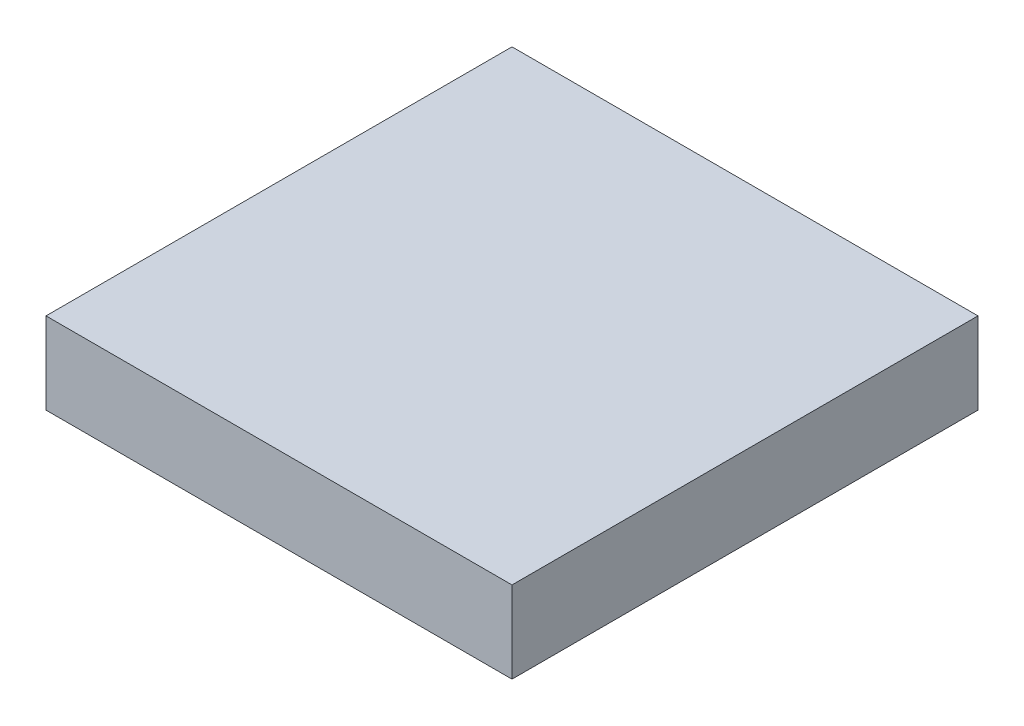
ISO-10303-21;
HEADER;
FILE_DESCRIPTION(('STEP AP214'),'2;1');
FILE_NAME('part.step','',(''),(''),'','','');
FILE_SCHEMA(('AUTOMOTIVE_DESIGN { 1 0 10303 214 1 1 1 1 }'));
ENDSEC;
DATA;
#1=APPLICATION_CONTEXT('core data for automotive mechanical design processes');
#2=APPLICATION_PROTOCOL_DEFINITION('international standard','automotive_design',2000,#1);
#3=PRODUCT_CONTEXT('',#1,'mechanical');
#4=PRODUCT('Part','Part','',(#3));
#5=PRODUCT_RELATED_PRODUCT_CATEGORY('part','',(#4));
#6=PRODUCT_DEFINITION_FORMATION('','',#4);
#7=PRODUCT_DEFINITION_CONTEXT('part definition',#1,'design');
#8=PRODUCT_DEFINITION('design','',#6,#7);
#9=PRODUCT_DEFINITION_SHAPE('','',#8);
#10=(LENGTH_UNIT() NAMED_UNIT(*) SI_UNIT(.MILLI.,.METRE.));
#11=(NAMED_UNIT(*) PLANE_ANGLE_UNIT() SI_UNIT($,.RADIAN.));
#12=(NAMED_UNIT(*) SI_UNIT($,.STERADIAN.) SOLID_ANGLE_UNIT());
#13=UNCERTAINTY_MEASURE_WITH_UNIT(LENGTH_MEASURE(1.E-05),#10,'distance_accuracy_value','');
#14=(GEOMETRIC_REPRESENTATION_CONTEXT(3) GLOBAL_UNCERTAINTY_ASSIGNED_CONTEXT((#13)) GLOBAL_UNIT_ASSIGNED_CONTEXT((#10,
#11,#12)) REPRESENTATION_CONTEXT('',''));
#15=CARTESIAN_POINT('',(0.,0.,0.));
#16=DIRECTION('',(0.,0.,1.));
#17=DIRECTION('',(1.,0.,0.));
#18=AXIS2_PLACEMENT_3D('',#15,#16,#17);
#19=CARTESIAN_POINT('',(145.,50.8,145.));
#20=DIRECTION('',(-1.,0.,0.));
#21=DIRECTION('',(0.,0.,1.));
#22=AXIS2_PLACEMENT_3D('',#19,#20,#21);
#23=PLANE('',#22);
#24=DIRECTION('',(0.,0.,-1.));
#25=VECTOR('',#24,1.);
#26=CARTESIAN_POINT('',(145.,0.,145.));
#27=LINE('',#26,#25);
#28=CARTESIAN_POINT('',(145.,0.,145.));
#29=VERTEX_POINT('',#28);
#30=CARTESIAN_POINT('',(145.,0.,-145.));
#31=VERTEX_POINT('',#30);
#32=EDGE_CURVE('E114',#29,#31,#27,.T.);
#33=ORIENTED_EDGE('',*,*,#32,.T.);
#34=DIRECTION('',(0.,-1.,0.));
#35=VECTOR('',#34,1.);
#36=CARTESIAN_POINT('',(145.,50.8,-145.));
#37=LINE('',#36,#35);
#38=CARTESIAN_POINT('',(145.,50.8,-145.));
#39=VERTEX_POINT('',#38);
#40=EDGE_CURVE('E11',#39,#31,#37,.T.);
#41=ORIENTED_EDGE('',*,*,#40,.F.);
#42=DIRECTION('',(0.,0.,-1.));
#43=VECTOR('',#42,1.);
#44=CARTESIAN_POINT('',(145.,50.8,145.));
#45=LINE('',#44,#43);
#46=CARTESIAN_POINT('',(145.,50.8,145.));
#47=VERTEX_POINT('',#46);
#48=EDGE_CURVE('E100',#47,#39,#45,.T.);
#49=ORIENTED_EDGE('',*,*,#48,.F.);
#50=DIRECTION('',(0.,-1.,0.));
#51=VECTOR('',#50,1.);
#52=CARTESIAN_POINT('',(145.,50.8,145.));
#53=LINE('',#52,#51);
#54=EDGE_CURVE('E108',#47,#29,#53,.T.);
#55=ORIENTED_EDGE('',*,*,#54,.T.);
#56=EDGE_LOOP('',(#33,#41,#49,#55));
#57=FACE_BOUND('',#56,.T.);
#58=ADVANCED_FACE('F44',(#57),#23,.F.);
#59=CARTESIAN_POINT('',(145.,50.8,-145.));
#60=DIRECTION('',(0.,0.,1.));
#61=DIRECTION('',(1.,0.,0.));
#62=AXIS2_PLACEMENT_3D('',#59,#60,#61);
#63=PLANE('',#62);
#64=DIRECTION('',(-1.,0.,0.));
#65=VECTOR('',#64,1.);
#66=CARTESIAN_POINT('',(145.,0.,-145.));
#67=LINE('',#66,#65);
#68=CARTESIAN_POINT('',(-145.,0.,-145.));
#69=VERTEX_POINT('',#68);
#70=EDGE_CURVE('E105',#31,#69,#67,.T.);
#71=ORIENTED_EDGE('',*,*,#70,.T.);
#72=DIRECTION('',(0.,-1.,0.));
#73=VECTOR('',#72,1.);
#74=CARTESIAN_POINT('',(-145.,50.8,-145.));
#75=LINE('',#74,#73);
#76=CARTESIAN_POINT('',(-145.,50.8,-145.));
#77=VERTEX_POINT('',#76);
#78=EDGE_CURVE('E53',#77,#69,#75,.T.);
#79=ORIENTED_EDGE('',*,*,#78,.F.);
#80=DIRECTION('',(-1.,0.,0.));
#81=VECTOR('',#80,1.);
#82=CARTESIAN_POINT('',(145.,50.8,-145.));
#83=LINE('',#82,#81);
#84=EDGE_CURVE('E95',#39,#77,#83,.T.);
#85=ORIENTED_EDGE('',*,*,#84,.F.);
#86=ORIENTED_EDGE('',*,*,#40,.T.);
#87=EDGE_LOOP('',(#71,#79,#85,#86));
#88=FACE_BOUND('',#87,.T.);
#89=ADVANCED_FACE('F101',(#88),#63,.F.);
#90=CARTESIAN_POINT('',(-145.,50.8,145.));
#91=DIRECTION('',(1.,0.,0.));
#92=DIRECTION('',(0.,0.,-1.));
#93=AXIS2_PLACEMENT_3D('',#90,#91,#92);
#94=PLANE('',#93);
#95=DIRECTION('',(0.,0.,1.));
#96=VECTOR('',#95,1.);
#97=CARTESIAN_POINT('',(-145.,0.,145.));
#98=LINE('',#97,#96);
#99=CARTESIAN_POINT('',(-145.,0.,145.));
#100=VERTEX_POINT('',#99);
#101=EDGE_CURVE('E77',#69,#100,#98,.T.);
#102=ORIENTED_EDGE('',*,*,#101,.T.);
#103=DIRECTION('',(0.,-1.,0.));
#104=VECTOR('',#103,1.);
#105=CARTESIAN_POINT('',(-145.,50.8,145.));
#106=LINE('',#105,#104);
#107=CARTESIAN_POINT('',(-145.,50.8,145.));
#108=VERTEX_POINT('',#107);
#109=EDGE_CURVE('E102',#108,#100,#106,.T.);
#110=ORIENTED_EDGE('',*,*,#109,.F.);
#111=DIRECTION('',(0.,0.,1.));
#112=VECTOR('',#111,1.);
#113=CARTESIAN_POINT('',(-145.,50.8,145.));
#114=LINE('',#113,#112);
#115=EDGE_CURVE('E92',#77,#108,#114,.T.);
#116=ORIENTED_EDGE('',*,*,#115,.F.);
#117=ORIENTED_EDGE('',*,*,#78,.T.);
#118=EDGE_LOOP('',(#102,#110,#116,#117));
#119=FACE_BOUND('',#118,.T.);
#120=ADVANCED_FACE('F104',(#119),#94,.F.);
#121=CARTESIAN_POINT('',(145.,50.8,145.));
#122=DIRECTION('',(0.,0.,-1.));
#123=DIRECTION('',(-1.,0.,0.));
#124=AXIS2_PLACEMENT_3D('',#121,#122,#123);
#125=PLANE('',#124);
#126=DIRECTION('',(1.,0.,0.));
#127=VECTOR('',#126,1.);
#128=CARTESIAN_POINT('',(145.,0.,145.));
#129=LINE('',#128,#127);
#130=EDGE_CURVE('E81',#100,#29,#129,.T.);
#131=ORIENTED_EDGE('',*,*,#130,.T.);
#132=ORIENTED_EDGE('',*,*,#54,.F.);
#133=DIRECTION('',(1.,0.,0.));
#134=VECTOR('',#133,1.);
#135=CARTESIAN_POINT('',(145.,50.8,145.));
#136=LINE('',#135,#134);
#137=EDGE_CURVE('E65',#108,#47,#136,.T.);
#138=ORIENTED_EDGE('',*,*,#137,.F.);
#139=ORIENTED_EDGE('',*,*,#109,.T.);
#140=EDGE_LOOP('',(#131,#132,#138,#139));
#141=FACE_BOUND('',#140,.T.);
#142=ADVANCED_FACE('F127',(#141),#125,.F.);
#143=CARTESIAN_POINT('',(0.,50.8,0.));
#144=DIRECTION('',(0.,1.,0.));
#145=DIRECTION('',(0.,0.,1.));
#146=AXIS2_PLACEMENT_3D('',#143,#144,#145);
#147=PLANE('',#146);
#148=ORIENTED_EDGE('',*,*,#48,.T.);
#149=ORIENTED_EDGE('',*,*,#84,.T.);
#150=ORIENTED_EDGE('',*,*,#115,.T.);
#151=ORIENTED_EDGE('',*,*,#137,.T.);
#152=EDGE_LOOP('',(#148,#149,#150,#151));
#153=FACE_BOUND('',#152,.T.);
#154=ADVANCED_FACE('F91',(#153),#147,.T.);
#155=CARTESIAN_POINT('',(0.,0.,0.));
#156=DIRECTION('',(0.,1.,0.));
#157=DIRECTION('',(0.,0.,1.));
#158=AXIS2_PLACEMENT_3D('',#155,#156,#157);
#159=PLANE('',#158);
#160=ORIENTED_EDGE('',*,*,#32,.F.);
#161=ORIENTED_EDGE('',*,*,#130,.F.);
#162=ORIENTED_EDGE('',*,*,#101,.F.);
#163=ORIENTED_EDGE('',*,*,#70,.F.);
#164=EDGE_LOOP('',(#160,#161,#162,#163));
#165=FACE_BOUND('',#164,.T.);
#166=ADVANCED_FACE('F129',(#165),#159,.F.);
#167=CLOSED_SHELL('',(#58,#89,#120,#142,#154,#166));
#168=MANIFOLD_SOLID_BREP('B2',#167);
#169=ADVANCED_BREP_SHAPE_REPRESENTATION('',(#18,#168),#14);
#170=SHAPE_DEFINITION_REPRESENTATION(#9,#169);
ENDSEC;
END-ISO-10303-21;
